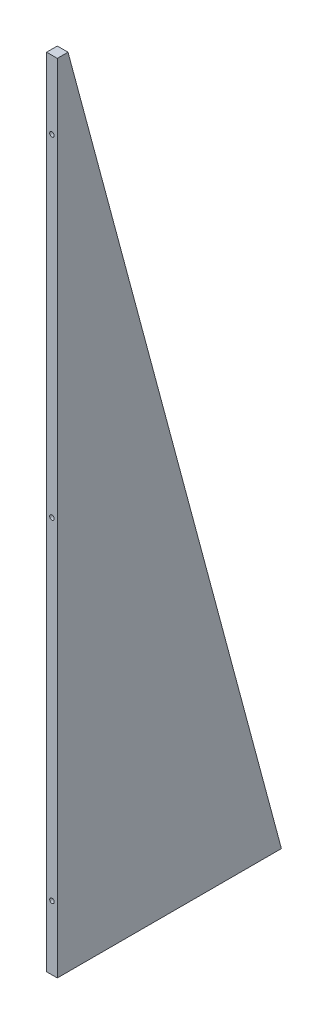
ISO-10303-21;
HEADER;
FILE_DESCRIPTION(('STEP AP214'),'2;1');
FILE_NAME('part.step','',(''),(''),'','','');
FILE_SCHEMA(('AUTOMOTIVE_DESIGN { 1 0 10303 214 1 1 1 1 }'));
ENDSEC;
DATA;
#1=APPLICATION_CONTEXT('core data for automotive mechanical design processes');
#2=APPLICATION_PROTOCOL_DEFINITION('international standard','automotive_design',2000,#1);
#3=PRODUCT_CONTEXT('',#1,'mechanical');
#4=PRODUCT('Part','Part','',(#3));
#5=PRODUCT_RELATED_PRODUCT_CATEGORY('part','',(#4));
#6=PRODUCT_DEFINITION_FORMATION('','',#4);
#7=PRODUCT_DEFINITION_CONTEXT('part definition',#1,'design');
#8=PRODUCT_DEFINITION('design','',#6,#7);
#9=PRODUCT_DEFINITION_SHAPE('','',#8);
#10=(LENGTH_UNIT() NAMED_UNIT(*) SI_UNIT(.MILLI.,.METRE.));
#11=(NAMED_UNIT(*) PLANE_ANGLE_UNIT() SI_UNIT($,.RADIAN.));
#12=(NAMED_UNIT(*) SI_UNIT($,.STERADIAN.) SOLID_ANGLE_UNIT());
#13=UNCERTAINTY_MEASURE_WITH_UNIT(LENGTH_MEASURE(1.E-05),#10,'distance_accuracy_value','');
#14=(GEOMETRIC_REPRESENTATION_CONTEXT(3) GLOBAL_UNCERTAINTY_ASSIGNED_CONTEXT((#13)) GLOBAL_UNIT_ASSIGNED_CONTEXT((#10,
#11,#12)) REPRESENTATION_CONTEXT('',''));
#15=CARTESIAN_POINT('',(0.,0.,0.));
#16=DIRECTION('',(0.,0.,1.));
#17=DIRECTION('',(1.,0.,0.));
#18=AXIS2_PLACEMENT_3D('',#15,#16,#17);
#19=CARTESIAN_POINT('',(6.35,472.44,-6.35));
#20=DIRECTION('',(0.,-1.,0.));
#21=DIRECTION('',(0.,0.,-1.));
#22=AXIS2_PLACEMENT_3D('',#19,#20,#21);
#23=PLANE('',#22);
#24=DIRECTION('',(0.,0.,1.));
#25=VECTOR('',#24,1.);
#26=CARTESIAN_POINT('',(0.,472.44,-6.35));
#27=LINE('',#26,#25);
#28=CARTESIAN_POINT('',(0.,472.44,-6.35));
#29=VERTEX_POINT('',#28);
#30=CARTESIAN_POINT('',(0.,472.44,0.));
#31=VERTEX_POINT('',#30);
#32=EDGE_CURVE('E141',#29,#31,#27,.T.);
#33=ORIENTED_EDGE('',*,*,#32,.T.);
#34=DIRECTION('',(-1.,0.,0.));
#35=VECTOR('',#34,1.);
#36=CARTESIAN_POINT('',(6.35,472.44,0.));
#37=LINE('',#36,#35);
#38=CARTESIAN_POINT('',(6.35,472.44,0.));
#39=VERTEX_POINT('',#38);
#40=EDGE_CURVE('E11',#39,#31,#37,.T.);
#41=ORIENTED_EDGE('',*,*,#40,.F.);
#42=DIRECTION('',(0.,0.,1.));
#43=VECTOR('',#42,1.);
#44=CARTESIAN_POINT('',(6.35,472.44,-6.35));
#45=LINE('',#44,#43);
#46=CARTESIAN_POINT('',(6.35,472.44,-6.35));
#47=VERTEX_POINT('',#46);
#48=EDGE_CURVE('E142',#47,#39,#45,.T.);
#49=ORIENTED_EDGE('',*,*,#48,.F.);
#50=DIRECTION('',(-1.,0.,0.));
#51=VECTOR('',#50,1.);
#52=CARTESIAN_POINT('',(6.35,472.44,-6.35));
#53=LINE('',#52,#51);
#54=EDGE_CURVE('E148',#47,#29,#53,.T.);
#55=ORIENTED_EDGE('',*,*,#54,.T.);
#56=EDGE_LOOP('',(#33,#41,#49,#55));
#57=FACE_BOUND('',#56,.T.);
#58=ADVANCED_FACE('F39',(#57),#23,.F.);
#59=CARTESIAN_POINT('',(6.35,472.44,0.));
#60=DIRECTION('',(0.,0.,-1.));
#61=DIRECTION('',(0.,1.,0.));
#62=AXIS2_PLACEMENT_3D('',#59,#60,#61);
#63=PLANE('',#62);
#64=CARTESIAN_POINT('',(3.17499999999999,38.1,0.));
#65=DIRECTION('',(0.,0.,1.));
#66=DIRECTION('',(1.,0.,0.));
#67=AXIS2_PLACEMENT_3D('',#64,#65,#66);
#68=CIRCLE('',#67,1.35254999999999);
#69=CARTESIAN_POINT('',(4.52754999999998,38.1,0.));
#70=VERTEX_POINT('',#69);
#71=EDGE_CURVE('E113',#70,#70,#68,.T.);
#72=ORIENTED_EDGE('',*,*,#71,.F.);
#73=EDGE_LOOP('',(#72));
#74=FACE_BOUND('',#73,.T.);
#75=CARTESIAN_POINT('',(3.17499999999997,234.95,0.));
#76=DIRECTION('',(0.,0.,1.));
#77=DIRECTION('',(1.,0.,0.));
#78=AXIS2_PLACEMENT_3D('',#75,#76,#77);
#79=CIRCLE('',#78,1.35254999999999);
#80=CARTESIAN_POINT('',(4.52754999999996,234.95,0.));
#81=VERTEX_POINT('',#80);
#82=EDGE_CURVE('E112',#81,#81,#79,.T.);
#83=ORIENTED_EDGE('',*,*,#82,.F.);
#84=EDGE_LOOP('',(#83));
#85=FACE_BOUND('',#84,.T.);
#86=CARTESIAN_POINT('',(3.17499999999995,431.8,0.));
#87=DIRECTION('',(0.,0.,1.));
#88=DIRECTION('',(1.,0.,0.));
#89=AXIS2_PLACEMENT_3D('',#86,#87,#88);
#90=CIRCLE('',#89,1.35254999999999);
#91=CARTESIAN_POINT('',(4.52754999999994,431.8,0.));
#92=VERTEX_POINT('',#91);
#93=EDGE_CURVE('E123',#92,#92,#90,.T.);
#94=ORIENTED_EDGE('',*,*,#93,.F.);
#95=EDGE_LOOP('',(#94));
#96=FACE_BOUND('',#95,.T.);
#97=DIRECTION('',(0.,-1.,0.));
#98=VECTOR('',#97,1.);
#99=CARTESIAN_POINT('',(0.,472.44,0.));
#100=LINE('',#99,#98);
#101=CARTESIAN_POINT('',(0.,0.,0.));
#102=VERTEX_POINT('',#101);
#103=EDGE_CURVE('E151',#31,#102,#100,.T.);
#104=ORIENTED_EDGE('',*,*,#103,.T.);
#105=DIRECTION('',(-1.,0.,0.));
#106=VECTOR('',#105,1.);
#107=CARTESIAN_POINT('',(6.35,0.,0.));
#108=LINE('',#107,#106);
#109=CARTESIAN_POINT('',(6.35,0.,0.));
#110=VERTEX_POINT('',#109);
#111=EDGE_CURVE('E47',#110,#102,#108,.T.);
#112=ORIENTED_EDGE('',*,*,#111,.F.);
#113=DIRECTION('',(0.,-1.,0.));
#114=VECTOR('',#113,1.);
#115=CARTESIAN_POINT('',(6.35,472.44,0.));
#116=LINE('',#115,#114);
#117=EDGE_CURVE('E86',#39,#110,#116,.T.);
#118=ORIENTED_EDGE('',*,*,#117,.F.);
#119=ORIENTED_EDGE('',*,*,#40,.T.);
#120=EDGE_LOOP('',(#104,#112,#118,#119));
#121=FACE_BOUND('',#120,.T.);
#122=ADVANCED_FACE('F174',(#74,#85,#96,#121),#63,.F.);
#123=CARTESIAN_POINT('',(6.35,0.,0.));
#124=DIRECTION('',(0.,1.,0.));
#125=DIRECTION('',(0.,0.,1.));
#126=AXIS2_PLACEMENT_3D('',#123,#124,#125);
#127=PLANE('',#126);
#128=CARTESIAN_POINT('',(3.175,0.,-25.4));
#129=DIRECTION('',(0.,-1.,0.));
#130=DIRECTION('',(0.,0.,-1.));
#131=AXIS2_PLACEMENT_3D('',#128,#129,#130);
#132=CIRCLE('',#131,1.35255);
#133=CARTESIAN_POINT('',(3.175,0.,-26.75255));
#134=VERTEX_POINT('',#133);
#135=EDGE_CURVE('E129',#134,#134,#132,.T.);
#136=ORIENTED_EDGE('',*,*,#135,.F.);
#137=EDGE_LOOP('',(#136));
#138=FACE_BOUND('',#137,.T.);
#139=CARTESIAN_POINT('',(3.175,0.,-127.));
#140=DIRECTION('',(0.,-1.,0.));
#141=DIRECTION('',(0.,0.,-1.));
#142=AXIS2_PLACEMENT_3D('',#139,#140,#141);
#143=CIRCLE('',#142,1.35255);
#144=CARTESIAN_POINT('',(3.175,0.,-128.35255));
#145=VERTEX_POINT('',#144);
#146=EDGE_CURVE('E135',#145,#145,#143,.T.);
#147=ORIENTED_EDGE('',*,*,#146,.F.);
#148=EDGE_LOOP('',(#147));
#149=FACE_BOUND('',#148,.T.);
#150=DIRECTION('',(0.,0.,-1.));
#151=VECTOR('',#150,1.);
#152=CARTESIAN_POINT('',(0.,0.,0.));
#153=LINE('',#152,#151);
#154=CARTESIAN_POINT('',(0.,0.,-132.939916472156));
#155=VERTEX_POINT('',#154);
#156=EDGE_CURVE('E73',#102,#155,#153,.T.);
#157=ORIENTED_EDGE('',*,*,#156,.T.);
#158=DIRECTION('',(-1.,0.,0.));
#159=VECTOR('',#158,1.);
#160=CARTESIAN_POINT('',(6.35,0.,-132.939916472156));
#161=LINE('',#160,#159);
#162=CARTESIAN_POINT('',(6.35,0.,-132.939916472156));
#163=VERTEX_POINT('',#162);
#164=EDGE_CURVE('E156',#163,#155,#161,.T.);
#165=ORIENTED_EDGE('',*,*,#164,.F.);
#166=DIRECTION('',(0.,0.,-1.));
#167=VECTOR('',#166,1.);
#168=CARTESIAN_POINT('',(6.35,0.,0.));
#169=LINE('',#168,#167);
#170=EDGE_CURVE('E145',#110,#163,#169,.T.);
#171=ORIENTED_EDGE('',*,*,#170,.F.);
#172=ORIENTED_EDGE('',*,*,#111,.T.);
#173=EDGE_LOOP('',(#157,#165,#171,#172));
#174=FACE_BOUND('',#173,.T.);
#175=ADVANCED_FACE('F158',(#138,#149,#174),#127,.F.);
#176=CARTESIAN_POINT('',(6.35,0.,-132.939916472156));
#177=DIRECTION('',(0.,-0.258819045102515,0.96592582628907));
#178=DIRECTION('',(0.,-0.96592582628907,-0.258819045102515));
#179=AXIS2_PLACEMENT_3D('',#176,#177,#178);
#180=PLANE('',#179);
#181=DIRECTION('',(0.,0.96592582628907,0.258819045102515));
#182=VECTOR('',#181,1.);
#183=CARTESIAN_POINT('',(0.,0.,-132.939916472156));
#184=LINE('',#183,#182);
#185=EDGE_CURVE('E79',#155,#29,#184,.T.);
#186=ORIENTED_EDGE('',*,*,#185,.T.);
#187=ORIENTED_EDGE('',*,*,#54,.F.);
#188=DIRECTION('',(0.,0.96592582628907,0.258819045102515));
#189=VECTOR('',#188,1.);
#190=CARTESIAN_POINT('',(6.35,0.,-132.939916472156));
#191=LINE('',#190,#189);
#192=EDGE_CURVE('E55',#163,#47,#191,.T.);
#193=ORIENTED_EDGE('',*,*,#192,.F.);
#194=ORIENTED_EDGE('',*,*,#164,.T.);
#195=EDGE_LOOP('',(#186,#187,#193,#194));
#196=FACE_BOUND('',#195,.T.);
#197=ADVANCED_FACE('F165',(#196),#180,.F.);
#198=CARTESIAN_POINT('',(6.35,0.,0.));
#199=DIRECTION('',(1.,0.,0.));
#200=DIRECTION('',(0.,0.,-1.));
#201=AXIS2_PLACEMENT_3D('',#198,#199,#200);
#202=PLANE('',#201);
#203=ORIENTED_EDGE('',*,*,#48,.T.);
#204=ORIENTED_EDGE('',*,*,#117,.T.);
#205=ORIENTED_EDGE('',*,*,#170,.T.);
#206=ORIENTED_EDGE('',*,*,#192,.T.);
#207=EDGE_LOOP('',(#203,#204,#205,#206));
#208=FACE_BOUND('',#207,.T.);
#209=ADVANCED_FACE('F167',(#208),#202,.T.);
#210=CARTESIAN_POINT('',(0.,0.,0.));
#211=DIRECTION('',(1.,0.,0.));
#212=DIRECTION('',(0.,0.,-1.));
#213=AXIS2_PLACEMENT_3D('',#210,#211,#212);
#214=PLANE('',#213);
#215=ORIENTED_EDGE('',*,*,#32,.F.);
#216=ORIENTED_EDGE('',*,*,#185,.F.);
#217=ORIENTED_EDGE('',*,*,#156,.F.);
#218=ORIENTED_EDGE('',*,*,#103,.F.);
#219=EDGE_LOOP('',(#215,#216,#217,#218));
#220=FACE_BOUND('',#219,.T.);
#221=ADVANCED_FACE('F161',(#220),#214,.F.);
#222=CARTESIAN_POINT('',(3.175,10.9728,-127.));
#223=DIRECTION('',(0.,-1.,0.));
#224=DIRECTION('',(0.,0.,-1.));
#225=AXIS2_PLACEMENT_3D('',#222,#223,#224);
#226=CONICAL_SURFACE('',#225,1.35255,1.02974425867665);
#227=CARTESIAN_POINT('',(3.175,11.7854940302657,-127.));
#228=VERTEX_POINT('',#227);
#229=VERTEX_LOOP('',#228);
#230=FACE_BOUND('',#229,.T.);
#231=CARTESIAN_POINT('',(3.175,10.9728,-127.));
#232=DIRECTION('',(0.,-1.,0.));
#233=DIRECTION('',(0.,0.,-1.));
#234=AXIS2_PLACEMENT_3D('',#231,#232,#233);
#235=CIRCLE('',#234,1.35255);
#236=CARTESIAN_POINT('',(3.175,10.9728,-128.35255));
#237=VERTEX_POINT('',#236);
#238=EDGE_CURVE('E138',#237,#237,#235,.T.);
#239=ORIENTED_EDGE('',*,*,#238,.T.);
#240=EDGE_LOOP('',(#239));
#241=FACE_BOUND('',#240,.T.);
#242=ADVANCED_FACE('F221',(#230,#241),#226,.F.);
#243=CARTESIAN_POINT('',(3.175,0.,-127.));
#244=DIRECTION('',(0.,-1.,0.));
#245=DIRECTION('',(0.,0.,-1.));
#246=AXIS2_PLACEMENT_3D('',#243,#244,#245);
#247=CYLINDRICAL_SURFACE('',#246,1.35255);
#248=ORIENTED_EDGE('',*,*,#238,.F.);
#249=EDGE_LOOP('',(#248));
#250=FACE_BOUND('',#249,.T.);
#251=ORIENTED_EDGE('',*,*,#146,.T.);
#252=EDGE_LOOP('',(#251));
#253=FACE_BOUND('',#252,.T.);
#254=ADVANCED_FACE('F217',(#250,#253),#247,.F.);
#255=CARTESIAN_POINT('',(3.175,10.9728,-25.4));
#256=DIRECTION('',(0.,-1.,0.));
#257=DIRECTION('',(0.,0.,-1.));
#258=AXIS2_PLACEMENT_3D('',#255,#256,#257);
#259=CONICAL_SURFACE('',#258,1.35255,1.02974425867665);
#260=CARTESIAN_POINT('',(3.175,11.7854940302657,-25.4));
#261=VERTEX_POINT('',#260);
#262=VERTEX_LOOP('',#261);
#263=FACE_BOUND('',#262,.T.);
#264=CARTESIAN_POINT('',(3.175,10.9728,-25.4));
#265=DIRECTION('',(0.,-1.,0.));
#266=DIRECTION('',(0.,0.,-1.));
#267=AXIS2_PLACEMENT_3D('',#264,#265,#266);
#268=CIRCLE('',#267,1.35255);
#269=CARTESIAN_POINT('',(3.175,10.9728,-26.75255));
#270=VERTEX_POINT('',#269);
#271=EDGE_CURVE('E132',#270,#270,#268,.T.);
#272=ORIENTED_EDGE('',*,*,#271,.T.);
#273=EDGE_LOOP('',(#272));
#274=FACE_BOUND('',#273,.T.);
#275=ADVANCED_FACE('F213',(#263,#274),#259,.F.);
#276=CARTESIAN_POINT('',(3.175,0.,-25.4));
#277=DIRECTION('',(0.,-1.,0.));
#278=DIRECTION('',(0.,0.,-1.));
#279=AXIS2_PLACEMENT_3D('',#276,#277,#278);
#280=CYLINDRICAL_SURFACE('',#279,1.35255);
#281=ORIENTED_EDGE('',*,*,#271,.F.);
#282=EDGE_LOOP('',(#281));
#283=FACE_BOUND('',#282,.T.);
#284=ORIENTED_EDGE('',*,*,#135,.T.);
#285=EDGE_LOOP('',(#284));
#286=FACE_BOUND('',#285,.T.);
#287=ADVANCED_FACE('F205',(#283,#286),#280,.F.);
#288=CARTESIAN_POINT('',(3.17499999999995,431.8,-10.9728));
#289=DIRECTION('',(0.,0.,1.));
#290=DIRECTION('',(1.,0.,0.));
#291=AXIS2_PLACEMENT_3D('',#288,#289,#290);
#292=CONICAL_SURFACE('',#291,1.35254999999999,1.02974425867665);
#293=CARTESIAN_POINT('',(3.17499999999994,431.8,-11.7854940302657));
#294=VERTEX_POINT('',#293);
#295=VERTEX_LOOP('',#294);
#296=FACE_BOUND('',#295,.T.);
#297=CARTESIAN_POINT('',(3.17499999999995,431.8,-10.9728));
#298=DIRECTION('',(0.,0.,1.));
#299=DIRECTION('',(1.,0.,0.));
#300=AXIS2_PLACEMENT_3D('',#297,#298,#299);
#301=CIRCLE('',#300,1.35254999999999);
#302=CARTESIAN_POINT('',(4.52754999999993,431.8,-10.9728));
#303=VERTEX_POINT('',#302);
#304=EDGE_CURVE('E126',#303,#303,#301,.T.);
#305=ORIENTED_EDGE('',*,*,#304,.T.);
#306=EDGE_LOOP('',(#305));
#307=FACE_BOUND('',#306,.T.);
#308=ADVANCED_FACE('F196',(#296,#307),#292,.F.);
#309=CARTESIAN_POINT('',(3.17499999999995,431.8,0.));
#310=DIRECTION('',(0.,0.,1.));
#311=DIRECTION('',(1.,0.,0.));
#312=AXIS2_PLACEMENT_3D('',#309,#310,#311);
#313=CYLINDRICAL_SURFACE('',#312,1.35254999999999);
#314=ORIENTED_EDGE('',*,*,#304,.F.);
#315=EDGE_LOOP('',(#314));
#316=FACE_BOUND('',#315,.T.);
#317=ORIENTED_EDGE('',*,*,#93,.T.);
#318=EDGE_LOOP('',(#317));
#319=FACE_BOUND('',#318,.T.);
#320=ADVANCED_FACE('F193',(#316,#319),#313,.F.);
#321=CARTESIAN_POINT('',(3.17499999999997,234.95,-10.9728));
#322=DIRECTION('',(0.,0.,1.));
#323=DIRECTION('',(1.,0.,0.));
#324=AXIS2_PLACEMENT_3D('',#321,#322,#323);
#325=CONICAL_SURFACE('',#324,1.35254999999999,1.02974425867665);
#326=CARTESIAN_POINT('',(3.17499999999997,234.95,-11.7854940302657));
#327=VERTEX_POINT('',#326);
#328=VERTEX_LOOP('',#327);
#329=FACE_BOUND('',#328,.T.);
#330=CARTESIAN_POINT('',(3.17499999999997,234.95,-10.9728));
#331=DIRECTION('',(0.,0.,1.));
#332=DIRECTION('',(1.,0.,0.));
#333=AXIS2_PLACEMENT_3D('',#330,#331,#332);
#334=CIRCLE('',#333,1.35254999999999);
#335=CARTESIAN_POINT('',(4.52754999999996,234.95,-10.9728));
#336=VERTEX_POINT('',#335);
#337=EDGE_CURVE('E116',#336,#336,#334,.T.);
#338=ORIENTED_EDGE('',*,*,#337,.T.);
#339=EDGE_LOOP('',(#338));
#340=FACE_BOUND('',#339,.T.);
#341=ADVANCED_FACE('F195',(#329,#340),#325,.F.);
#342=CARTESIAN_POINT('',(3.17499999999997,234.95,0.));
#343=DIRECTION('',(0.,0.,1.));
#344=DIRECTION('',(1.,0.,0.));
#345=AXIS2_PLACEMENT_3D('',#342,#343,#344);
#346=CYLINDRICAL_SURFACE('',#345,1.35254999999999);
#347=ORIENTED_EDGE('',*,*,#337,.F.);
#348=EDGE_LOOP('',(#347));
#349=FACE_BOUND('',#348,.T.);
#350=ORIENTED_EDGE('',*,*,#82,.T.);
#351=EDGE_LOOP('',(#350));
#352=FACE_BOUND('',#351,.T.);
#353=ADVANCED_FACE('F106',(#349,#352),#346,.F.);
#354=CARTESIAN_POINT('',(3.17499999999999,38.1,-10.9728));
#355=DIRECTION('',(0.,0.,1.));
#356=DIRECTION('',(1.,0.,0.));
#357=AXIS2_PLACEMENT_3D('',#354,#355,#356);
#358=CONICAL_SURFACE('',#357,1.35254999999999,1.02974425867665);
#359=CARTESIAN_POINT('',(3.17499999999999,38.1,-11.7854940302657));
#360=VERTEX_POINT('',#359);
#361=VERTEX_LOOP('',#360);
#362=FACE_BOUND('',#361,.T.);
#363=CARTESIAN_POINT('',(3.17499999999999,38.1,-10.9728));
#364=DIRECTION('',(0.,0.,1.));
#365=DIRECTION('',(1.,0.,0.));
#366=AXIS2_PLACEMENT_3D('',#363,#364,#365);
#367=CIRCLE('',#366,1.35254999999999);
#368=CARTESIAN_POINT('',(4.52754999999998,38.1,-10.9728));
#369=VERTEX_POINT('',#368);
#370=EDGE_CURVE('E110',#369,#369,#367,.T.);
#371=ORIENTED_EDGE('',*,*,#370,.T.);
#372=EDGE_LOOP('',(#371));
#373=FACE_BOUND('',#372,.T.);
#374=ADVANCED_FACE('F102',(#362,#373),#358,.F.);
#375=CARTESIAN_POINT('',(3.17499999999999,38.1,0.));
#376=DIRECTION('',(0.,0.,1.));
#377=DIRECTION('',(1.,0.,0.));
#378=AXIS2_PLACEMENT_3D('',#375,#376,#377);
#379=CYLINDRICAL_SURFACE('',#378,1.35254999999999);
#380=ORIENTED_EDGE('',*,*,#370,.F.);
#381=EDGE_LOOP('',(#380));
#382=FACE_BOUND('',#381,.T.);
#383=ORIENTED_EDGE('',*,*,#71,.T.);
#384=EDGE_LOOP('',(#383));
#385=FACE_BOUND('',#384,.T.);
#386=ADVANCED_FACE('F105',(#382,#385),#379,.F.);
#387=CLOSED_SHELL('',(#58,#122,#175,#197,#209,#221,#242,#254,#275,#287,#308,#320,#341,#353,#374,#386));
#388=MANIFOLD_SOLID_BREP('B2',#387);
#389=ADVANCED_BREP_SHAPE_REPRESENTATION('',(#18,#388),#14);
#390=SHAPE_DEFINITION_REPRESENTATION(#9,#389);
ENDSEC;
END-ISO-10303-21;
